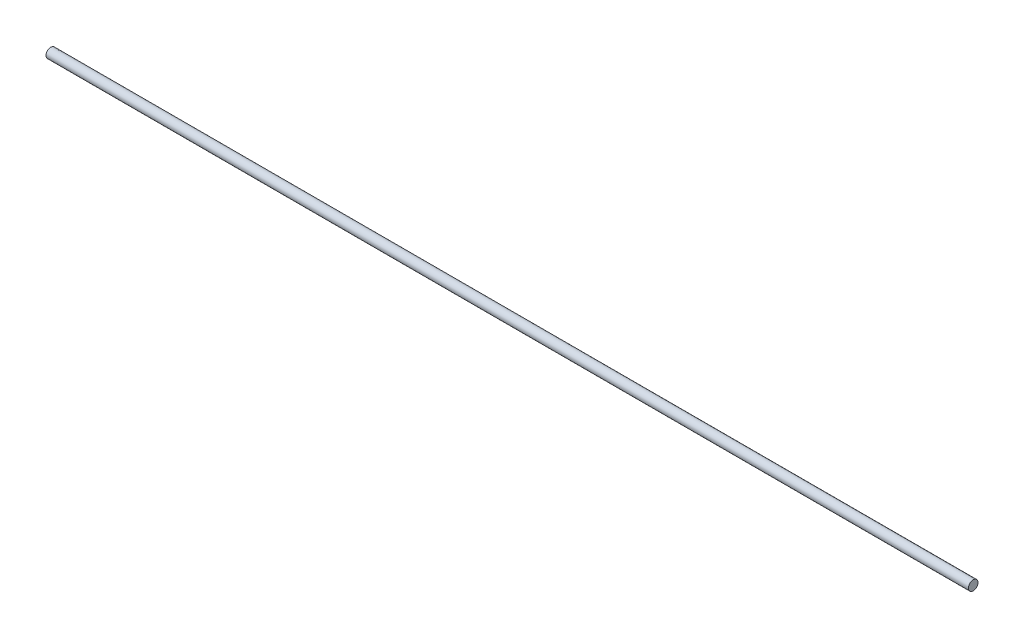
ISO-10303-21;
HEADER;
FILE_DESCRIPTION(('STEP AP214'),'2;1');
FILE_NAME('part.step','',(''),(''),'','','');
FILE_SCHEMA(('AUTOMOTIVE_DESIGN { 1 0 10303 214 1 1 1 1 }'));
ENDSEC;
DATA;
#1=APPLICATION_CONTEXT('core data for automotive mechanical design processes');
#2=APPLICATION_PROTOCOL_DEFINITION('international standard','automotive_design',2000,#1);
#3=PRODUCT_CONTEXT('',#1,'mechanical');
#4=PRODUCT('Part','Part','',(#3));
#5=PRODUCT_RELATED_PRODUCT_CATEGORY('part','',(#4));
#6=PRODUCT_DEFINITION_FORMATION('','',#4);
#7=PRODUCT_DEFINITION_CONTEXT('part definition',#1,'design');
#8=PRODUCT_DEFINITION('design','',#6,#7);
#9=PRODUCT_DEFINITION_SHAPE('','',#8);
#10=(LENGTH_UNIT() NAMED_UNIT(*) SI_UNIT(.MILLI.,.METRE.));
#11=(NAMED_UNIT(*) PLANE_ANGLE_UNIT() SI_UNIT($,.RADIAN.));
#12=(NAMED_UNIT(*) SI_UNIT($,.STERADIAN.) SOLID_ANGLE_UNIT());
#13=UNCERTAINTY_MEASURE_WITH_UNIT(LENGTH_MEASURE(1.E-05),#10,'distance_accuracy_value','');
#14=(GEOMETRIC_REPRESENTATION_CONTEXT(3) GLOBAL_UNCERTAINTY_ASSIGNED_CONTEXT((#13)) GLOBAL_UNIT_ASSIGNED_CONTEXT((#10,
#11,#12)) REPRESENTATION_CONTEXT('',''));
#15=CARTESIAN_POINT('',(0.,0.,0.));
#16=DIRECTION('',(0.,0.,1.));
#17=DIRECTION('',(1.,0.,0.));
#18=AXIS2_PLACEMENT_3D('',#15,#16,#17);
#19=CARTESIAN_POINT('',(385.,0.,0.));
#20=DIRECTION('',(-1.,0.,0.));
#21=DIRECTION('',(0.,0.,1.));
#22=AXIS2_PLACEMENT_3D('',#19,#20,#21);
#23=CYLINDRICAL_SURFACE('',#22,4.);
#24=CARTESIAN_POINT('',(385.,0.,0.));
#25=DIRECTION('',(1.,0.,0.));
#26=DIRECTION('',(0.,0.,-1.));
#27=AXIS2_PLACEMENT_3D('',#24,#25,#26);
#28=CIRCLE('',#27,4.);
#29=CARTESIAN_POINT('',(385.,0.,-4.));
#30=VERTEX_POINT('',#29);
#31=EDGE_CURVE('E10',#30,#30,#28,.T.);
#32=ORIENTED_EDGE('',*,*,#31,.F.);
#33=EDGE_LOOP('',(#32));
#34=FACE_BOUND('',#33,.T.);
#35=CARTESIAN_POINT('',(-385.,0.,0.));
#36=DIRECTION('',(1.,0.,0.));
#37=DIRECTION('',(0.,0.,-1.));
#38=AXIS2_PLACEMENT_3D('',#35,#36,#37);
#39=CIRCLE('',#38,4.);
#40=CARTESIAN_POINT('',(-385.,0.,-4.));
#41=VERTEX_POINT('',#40);
#42=EDGE_CURVE('E38',#41,#41,#39,.T.);
#43=ORIENTED_EDGE('',*,*,#42,.T.);
#44=EDGE_LOOP('',(#43));
#45=FACE_BOUND('',#44,.T.);
#46=ADVANCED_FACE('F35',(#34,#45),#23,.T.);
#47=CARTESIAN_POINT('',(385.,0.,0.));
#48=DIRECTION('',(1.,0.,0.));
#49=DIRECTION('',(0.,0.,-1.));
#50=AXIS2_PLACEMENT_3D('',#47,#48,#49);
#51=PLANE('',#50);
#52=ORIENTED_EDGE('',*,*,#31,.T.);
#53=EDGE_LOOP('',(#52));
#54=FACE_BOUND('',#53,.T.);
#55=ADVANCED_FACE('F54',(#54),#51,.T.);
#56=CARTESIAN_POINT('',(-385.,0.,0.));
#57=DIRECTION('',(1.,0.,0.));
#58=DIRECTION('',(0.,0.,-1.));
#59=AXIS2_PLACEMENT_3D('',#56,#57,#58);
#60=PLANE('',#59);
#61=ORIENTED_EDGE('',*,*,#42,.F.);
#62=EDGE_LOOP('',(#61));
#63=FACE_BOUND('',#62,.T.);
#64=ADVANCED_FACE('F52',(#63),#60,.F.);
#65=CLOSED_SHELL('',(#46,#55,#64));
#66=MANIFOLD_SOLID_BREP('B2',#65);
#67=ADVANCED_BREP_SHAPE_REPRESENTATION('',(#18,#66),#14);
#68=SHAPE_DEFINITION_REPRESENTATION(#9,#67);
ENDSEC;
END-ISO-10303-21;
